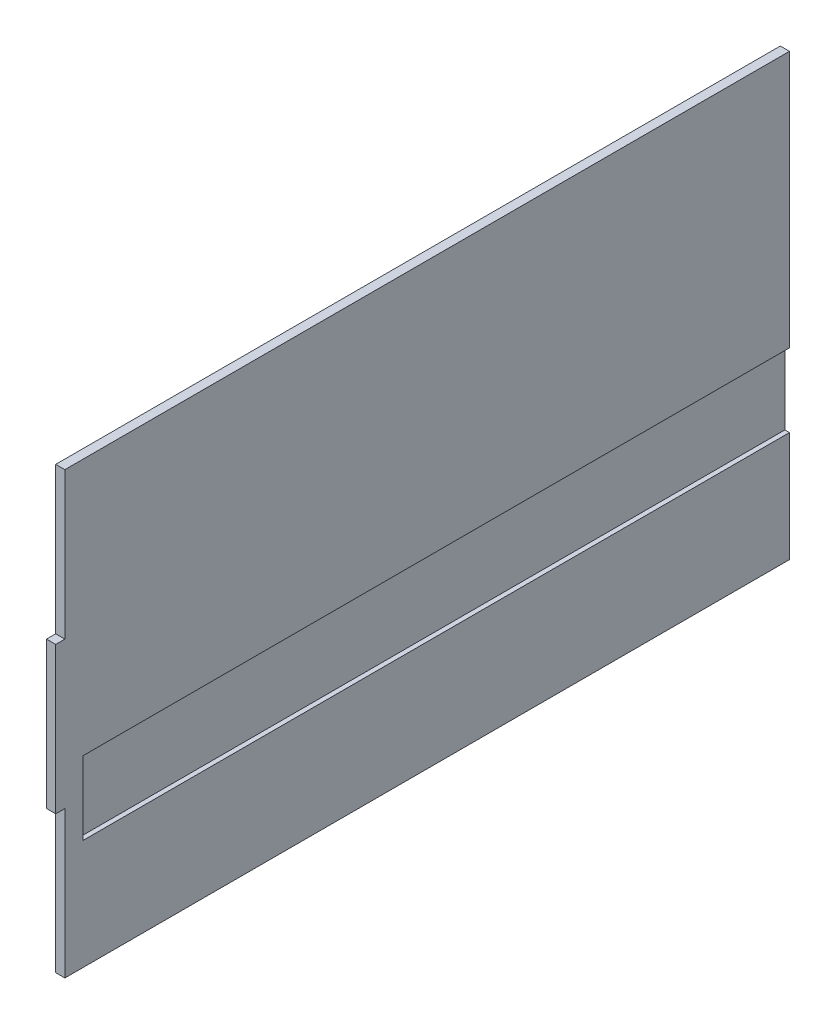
from build123d import *

# Parameters (mm, degrees)
SKETCH1_W           = 3.175
SKETCH1_H           = 254
BOSS_EXTRUDE1_DEPTH = 152.4
SKETCH3_W           = 3.175
SKETCH3_H           = 50.8
CUT_EXTRUDE2_DEPTH  = 199.40574746
SKETCH4_W           = 244.475
SKETCH4_H           = 25.4
CUT_EXTRUDE3_DEPTH  = 1.5875


with BuildPart() as part:
    # Sketch1 → Boss-Extrude1 (new body)
    with BuildSketch(Plane(origin=(0, 0, 0), x_dir=(1, 0, 0), z_dir=(0, 1, 0))):
        Rectangle(SKETCH1_W, SKETCH1_H)
    extrude(amount=BOSS_EXTRUDE1_DEPTH)

    # Sketch3 → Cut-Extrude2 (cut, through all)
    with BuildSketch(Plane.ZY.offset(1.5875)):
        with Locations((125.4125, 25.4)):
            Rectangle(SKETCH3_W, SKETCH3_H)
        with Locations((125.4125, 127)):
            Rectangle(SKETCH3_W, SKETCH3_H)
    extrude(amount=-CUT_EXTRUDE2_DEPTH, mode=Mode.SUBTRACT)

    # Sketch4 → Cut-Extrude3 (cut)
    with BuildSketch(Plane(origin=(1.5875, 0, 0), x_dir=(0, 0, -1), z_dir=(1, 0, 0))):
        with Locations((4.7625, 50.8)):
            Rectangle(SKETCH4_W, SKETCH4_H)
    extrude(amount=-CUT_EXTRUDE3_DEPTH, mode=Mode.SUBTRACT)


solid = part.part
